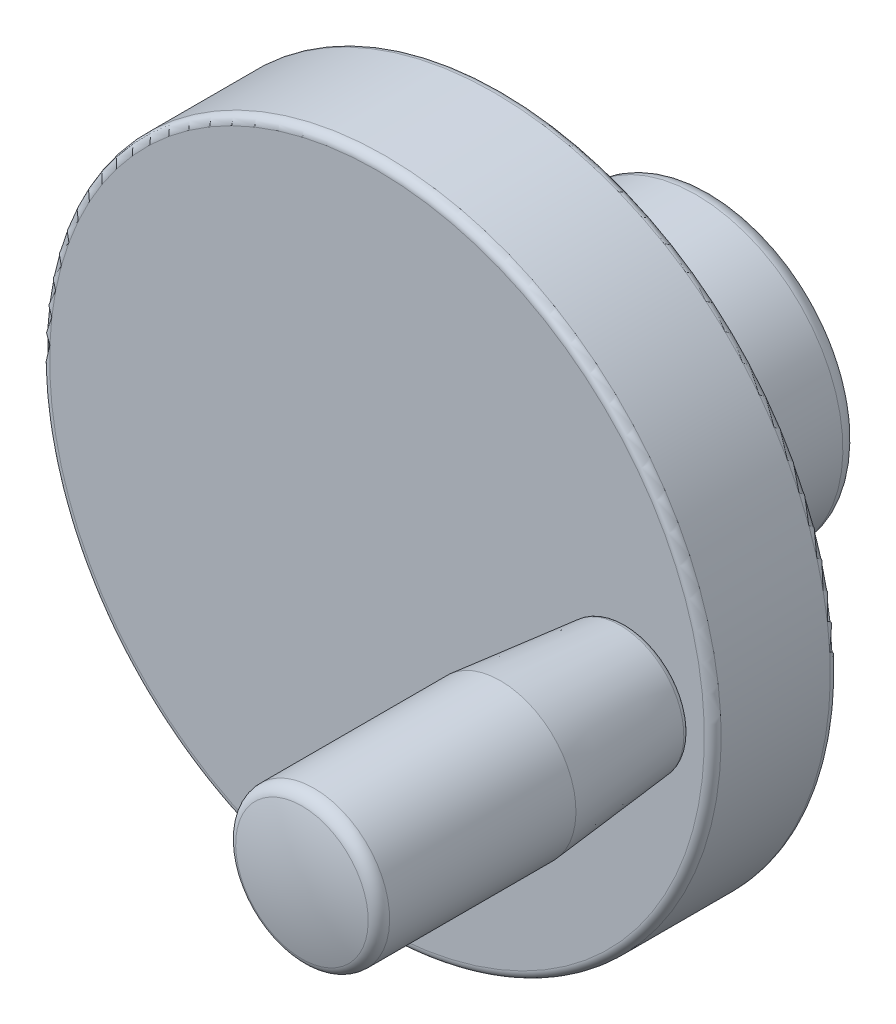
ISO-10303-21;
HEADER;
FILE_DESCRIPTION(('STEP AP214'),'2;1');
FILE_NAME('part.step','',(''),(''),'','','');
FILE_SCHEMA(('AUTOMOTIVE_DESIGN { 1 0 10303 214 1 1 1 1 }'));
ENDSEC;
DATA;
#1=APPLICATION_CONTEXT('core data for automotive mechanical design processes');
#2=APPLICATION_PROTOCOL_DEFINITION('international standard','automotive_design',2000,#1);
#3=PRODUCT_CONTEXT('',#1,'mechanical');
#4=PRODUCT('Part','Part','',(#3));
#5=PRODUCT_RELATED_PRODUCT_CATEGORY('part','',(#4));
#6=PRODUCT_DEFINITION_FORMATION('','',#4);
#7=PRODUCT_DEFINITION_CONTEXT('part definition',#1,'design');
#8=PRODUCT_DEFINITION('design','',#6,#7);
#9=PRODUCT_DEFINITION_SHAPE('','',#8);
#10=(LENGTH_UNIT() NAMED_UNIT(*) SI_UNIT(.MILLI.,.METRE.));
#11=(NAMED_UNIT(*) PLANE_ANGLE_UNIT() SI_UNIT($,.RADIAN.));
#12=(NAMED_UNIT(*) SI_UNIT($,.STERADIAN.) SOLID_ANGLE_UNIT());
#13=UNCERTAINTY_MEASURE_WITH_UNIT(LENGTH_MEASURE(1.E-05),#10,'distance_accuracy_value','');
#14=(GEOMETRIC_REPRESENTATION_CONTEXT(3) GLOBAL_UNCERTAINTY_ASSIGNED_CONTEXT((#13)) GLOBAL_UNIT_ASSIGNED_CONTEXT((#10,
#11,#12)) REPRESENTATION_CONTEXT('',''));
#15=CARTESIAN_POINT('',(0.,0.,0.));
#16=DIRECTION('',(0.,0.,1.));
#17=DIRECTION('',(1.,0.,0.));
#18=AXIS2_PLACEMENT_3D('',#15,#16,#17);
#19=CARTESIAN_POINT('',(0.,0.,40.));
#20=DIRECTION('',(0.,0.,1.));
#21=DIRECTION('',(0.,1.,0.));
#22=AXIS2_PLACEMENT_3D('',#19,#20,#21);
#23=PLANE('',#22);
#24=CARTESIAN_POINT('',(0.,0.,40.));
#25=DIRECTION('',(0.,0.,1.));
#26=DIRECTION('',(0.,1.,0.));
#27=AXIS2_PLACEMENT_3D('',#24,#25,#26);
#28=CIRCLE('',#27,39.);
#29=CARTESIAN_POINT('',(0.,39.,40.));
#30=VERTEX_POINT('',#29);
#31=EDGE_CURVE('E19',#30,#30,#28,.T.);
#32=ORIENTED_EDGE('',*,*,#31,.T.);
#33=EDGE_LOOP('',(#32));
#34=FACE_BOUND('',#33,.T.);
#35=CARTESIAN_POINT('',(30.,0.,40.));
#36=DIRECTION('',(0.,0.,1.));
#37=DIRECTION('',(0.,1.,0.));
#38=AXIS2_PLACEMENT_3D('',#35,#36,#37);
#39=CIRCLE('',#38,5.);
#40=CARTESIAN_POINT('',(30.,5.,40.));
#41=VERTEX_POINT('',#40);
#42=EDGE_CURVE('E62',#41,#41,#39,.T.);
#43=ORIENTED_EDGE('',*,*,#42,.F.);
#44=EDGE_LOOP('',(#43));
#45=FACE_BOUND('',#44,.T.);
#46=ADVANCED_FACE('F12',(#34,#45),#23,.T.);
#47=CARTESIAN_POINT('',(9.,0.,0.));
#48=DIRECTION('',(0.,0.,1.));
#49=DIRECTION('',(0.,1.,0.));
#50=AXIS2_PLACEMENT_3D('',#47,#48,#49);
#51=PLANE('',#50);
#52=CARTESIAN_POINT('',(0.,0.,0.));
#53=DIRECTION('',(0.,0.,1.));
#54=DIRECTION('',(0.,1.,0.));
#55=AXIS2_PLACEMENT_3D('',#52,#53,#54);
#56=CIRCLE('',#55,15.5);
#57=CARTESIAN_POINT('',(0.,15.5,0.));
#58=VERTEX_POINT('',#57);
#59=EDGE_CURVE('E44',#58,#58,#56,.T.);
#60=ORIENTED_EDGE('',*,*,#59,.F.);
#61=EDGE_LOOP('',(#60));
#62=FACE_BOUND('',#61,.T.);
#63=CARTESIAN_POINT('',(0.,0.,0.));
#64=DIRECTION('',(0.,0.,-1.));
#65=DIRECTION('',(0.,1.,0.));
#66=AXIS2_PLACEMENT_3D('',#63,#64,#65);
#67=CIRCLE('',#66,8.);
#68=CARTESIAN_POINT('',(0.,8.,0.));
#69=VERTEX_POINT('',#68);
#70=EDGE_CURVE('E68',#69,#69,#67,.T.);
#71=ORIENTED_EDGE('',*,*,#70,.F.);
#72=EDGE_LOOP('',(#71));
#73=FACE_BOUND('',#72,.T.);
#74=ADVANCED_FACE('F14',(#62,#73),#51,.F.);
#75=CARTESIAN_POINT('',(0.,0.,39.));
#76=DIRECTION('',(0.,0.,1.));
#77=DIRECTION('',(0.,1.,0.));
#78=AXIS2_PLACEMENT_3D('',#75,#76,#77);
#79=TOROIDAL_SURFACE('',#78,39.,1.);
#80=CARTESIAN_POINT('',(0.,0.,39.));
#81=DIRECTION('',(0.,0.,1.));
#82=DIRECTION('',(0.,1.,0.));
#83=AXIS2_PLACEMENT_3D('',#80,#81,#82);
#84=CIRCLE('',#83,40.);
#85=CARTESIAN_POINT('',(0.,40.,39.));
#86=VERTEX_POINT('',#85);
#87=EDGE_CURVE('E23',#86,#86,#84,.T.);
#88=ORIENTED_EDGE('',*,*,#87,.T.);
#89=EDGE_LOOP('',(#88));
#90=FACE_BOUND('',#89,.T.);
#91=ORIENTED_EDGE('',*,*,#31,.F.);
#92=EDGE_LOOP('',(#91));
#93=FACE_BOUND('',#92,.T.);
#94=ADVANCED_FACE('F75',(#90,#93),#79,.T.);
#95=CARTESIAN_POINT('',(0.,0.,45.));
#96=DIRECTION('',(0.,0.,1.));
#97=DIRECTION('',(0.,1.,0.));
#98=AXIS2_PLACEMENT_3D('',#95,#96,#97);
#99=CYLINDRICAL_SURFACE('',#98,40.);
#100=CARTESIAN_POINT('',(0.,0.,26.));
#101=DIRECTION('',(0.,0.,1.));
#102=DIRECTION('',(0.,1.,0.));
#103=AXIS2_PLACEMENT_3D('',#100,#101,#102);
#104=CIRCLE('',#103,40.);
#105=CARTESIAN_POINT('',(0.,40.,26.));
#106=VERTEX_POINT('',#105);
#107=EDGE_CURVE('E27',#106,#106,#104,.T.);
#108=ORIENTED_EDGE('',*,*,#107,.T.);
#109=EDGE_LOOP('',(#108));
#110=FACE_BOUND('',#109,.T.);
#111=ORIENTED_EDGE('',*,*,#87,.F.);
#112=EDGE_LOOP('',(#111));
#113=FACE_BOUND('',#112,.T.);
#114=ADVANCED_FACE('F82',(#110,#113),#99,.T.);
#115=CARTESIAN_POINT('',(0.,0.,26.));
#116=DIRECTION('',(0.,0.,1.));
#117=DIRECTION('',(0.,1.,0.));
#118=AXIS2_PLACEMENT_3D('',#115,#116,#117);
#119=TOROIDAL_SURFACE('',#118,39.,1.);
#120=CARTESIAN_POINT('',(0.,0.,25.));
#121=DIRECTION('',(0.,0.,1.));
#122=DIRECTION('',(0.,1.,0.));
#123=AXIS2_PLACEMENT_3D('',#120,#121,#122);
#124=CIRCLE('',#123,39.);
#125=CARTESIAN_POINT('',(0.,39.,25.));
#126=VERTEX_POINT('',#125);
#127=EDGE_CURVE('E32',#126,#126,#124,.T.);
#128=ORIENTED_EDGE('',*,*,#127,.T.);
#129=EDGE_LOOP('',(#128));
#130=FACE_BOUND('',#129,.T.);
#131=ORIENTED_EDGE('',*,*,#107,.F.);
#132=EDGE_LOOP('',(#131));
#133=FACE_BOUND('',#132,.T.);
#134=ADVANCED_FACE('F109',(#130,#133),#119,.T.);
#135=CARTESIAN_POINT('',(20.5,0.,25.));
#136=DIRECTION('',(0.,0.,1.));
#137=DIRECTION('',(0.,1.,0.));
#138=AXIS2_PLACEMENT_3D('',#135,#136,#137);
#139=PLANE('',#138);
#140=ORIENTED_EDGE('',*,*,#127,.F.);
#141=EDGE_LOOP('',(#140));
#142=FACE_BOUND('',#141,.T.);
#143=CARTESIAN_POINT('',(0.,0.,25.));
#144=DIRECTION('',(0.,0.,1.));
#145=DIRECTION('',(0.,1.,0.));
#146=AXIS2_PLACEMENT_3D('',#143,#144,#145);
#147=CIRCLE('',#146,20.5);
#148=CARTESIAN_POINT('',(0.,20.5,25.));
#149=VERTEX_POINT('',#148);
#150=EDGE_CURVE('E35',#149,#149,#147,.T.);
#151=ORIENTED_EDGE('',*,*,#150,.T.);
#152=EDGE_LOOP('',(#151));
#153=FACE_BOUND('',#152,.T.);
#154=ADVANCED_FACE('F103',(#142,#153),#139,.F.);
#155=CARTESIAN_POINT('',(0.,0.,22.));
#156=DIRECTION('',(0.,0.,1.));
#157=DIRECTION('',(0.,1.,0.));
#158=AXIS2_PLACEMENT_3D('',#155,#156,#157);
#159=TOROIDAL_SURFACE('',#158,20.5,3.);
#160=ORIENTED_EDGE('',*,*,#150,.F.);
#161=EDGE_LOOP('',(#160));
#162=FACE_BOUND('',#161,.T.);
#163=CARTESIAN_POINT('',(0.,0.,22.));
#164=DIRECTION('',(0.,0.,1.));
#165=DIRECTION('',(0.,1.,0.));
#166=AXIS2_PLACEMENT_3D('',#163,#164,#165);
#167=CIRCLE('',#166,17.5);
#168=CARTESIAN_POINT('',(0.,17.5,22.));
#169=VERTEX_POINT('',#168);
#170=EDGE_CURVE('E38',#169,#169,#167,.T.);
#171=ORIENTED_EDGE('',*,*,#170,.T.);
#172=EDGE_LOOP('',(#171));
#173=FACE_BOUND('',#172,.T.);
#174=ADVANCED_FACE('F98',(#162,#173),#159,.F.);
#175=CARTESIAN_POINT('',(0.,0.,45.));
#176=DIRECTION('',(0.,0.,1.));
#177=DIRECTION('',(0.,1.,0.));
#178=AXIS2_PLACEMENT_3D('',#175,#176,#177);
#179=CYLINDRICAL_SURFACE('',#178,17.5);
#180=CARTESIAN_POINT('',(0.,0.,2.));
#181=DIRECTION('',(0.,0.,1.));
#182=DIRECTION('',(0.,1.,0.));
#183=AXIS2_PLACEMENT_3D('',#180,#181,#182);
#184=CIRCLE('',#183,17.5);
#185=CARTESIAN_POINT('',(0.,17.5,2.));
#186=VERTEX_POINT('',#185);
#187=EDGE_CURVE('E41',#186,#186,#184,.T.);
#188=ORIENTED_EDGE('',*,*,#187,.T.);
#189=EDGE_LOOP('',(#188));
#190=FACE_BOUND('',#189,.T.);
#191=ORIENTED_EDGE('',*,*,#170,.F.);
#192=EDGE_LOOP('',(#191));
#193=FACE_BOUND('',#192,.T.);
#194=ADVANCED_FACE('F92',(#190,#193),#179,.T.);
#195=CARTESIAN_POINT('',(0.,0.,2.));
#196=DIRECTION('',(0.,0.,1.));
#197=DIRECTION('',(0.,1.,0.));
#198=AXIS2_PLACEMENT_3D('',#195,#196,#197);
#199=TOROIDAL_SURFACE('',#198,15.5,2.);
#200=ORIENTED_EDGE('',*,*,#59,.T.);
#201=EDGE_LOOP('',(#200));
#202=FACE_BOUND('',#201,.T.);
#203=ORIENTED_EDGE('',*,*,#187,.F.);
#204=EDGE_LOOP('',(#203));
#205=FACE_BOUND('',#204,.T.);
#206=ADVANCED_FACE('F88',(#202,#205),#199,.T.);
#207=CARTESIAN_POINT('',(30.,0.,77.4954523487));
#208=DIRECTION('',(0.,0.,1.));
#209=DIRECTION('',(0.,1.,0.));
#210=AXIS2_PLACEMENT_3D('',#207,#208,#209);
#211=TOROIDAL_SURFACE('',#210,7.50000665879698,1.49999674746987);
#212=CARTESIAN_POINT('',(30.,0.,77.495454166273));
#213=DIRECTION('',(0.,0.,1.));
#214=DIRECTION('',(0.,1.,0.));
#215=AXIS2_PLACEMENT_3D('',#212,#213,#214);
#216=CIRCLE('',#215,9.);
#217=CARTESIAN_POINT('',(30.,9.,77.495454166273));
#218=VERTEX_POINT('',#217);
#219=EDGE_CURVE('E47',#218,#218,#216,.T.);
#220=ORIENTED_EDGE('',*,*,#219,.T.);
#221=EDGE_LOOP('',(#220));
#222=FACE_BOUND('',#221,.T.);
#223=CARTESIAN_POINT('',(30.,0.,78.942578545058));
#224=DIRECTION('',(0.,0.,1.));
#225=DIRECTION('',(0.,1.,0.));
#226=AXIS2_PLACEMENT_3D('',#223,#224,#225);
#227=CIRCLE('',#226,7.89475497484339);
#228=CARTESIAN_POINT('',(30.,7.89475497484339,78.942578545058));
#229=VERTEX_POINT('',#228);
#230=EDGE_CURVE('E65',#229,#229,#227,.T.);
#231=ORIENTED_EDGE('',*,*,#230,.F.);
#232=EDGE_LOOP('',(#231));
#233=FACE_BOUND('',#232,.T.);
#234=ADVANCED_FACE('F91',(#222,#233),#211,.T.);
#235=CARTESIAN_POINT('',(30.,0.,85.));
#236=DIRECTION('',(0.,0.,1.));
#237=DIRECTION('',(0.,1.,0.));
#238=AXIS2_PLACEMENT_3D('',#235,#236,#237);
#239=CYLINDRICAL_SURFACE('',#238,9.);
#240=CARTESIAN_POINT('',(30.,0.,55.3));
#241=DIRECTION('',(0.,0.,1.));
#242=DIRECTION('',(0.,1.,0.));
#243=AXIS2_PLACEMENT_3D('',#240,#241,#242);
#244=CIRCLE('',#243,9.);
#245=CARTESIAN_POINT('',(30.,9.,55.3));
#246=VERTEX_POINT('',#245);
#247=EDGE_CURVE('E50',#246,#246,#244,.T.);
#248=ORIENTED_EDGE('',*,*,#247,.T.);
#249=EDGE_LOOP('',(#248));
#250=FACE_BOUND('',#249,.T.);
#251=ORIENTED_EDGE('',*,*,#219,.F.);
#252=EDGE_LOOP('',(#251));
#253=FACE_BOUND('',#252,.T.);
#254=ADVANCED_FACE('F171',(#250,#253),#239,.T.);
#255=CARTESIAN_POINT('',(30.,0.,55.3));
#256=DIRECTION('',(0.,0.,1.));
#257=DIRECTION('',(0.,1.,0.));
#258=AXIS2_PLACEMENT_3D('',#255,#256,#257);
#259=CONICAL_SURFACE('',#258,9.,0.0996686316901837);
#260=CARTESIAN_POINT('',(30.,0.,41.020397));
#261=DIRECTION('',(0.,0.,1.));
#262=DIRECTION('',(0.,1.,0.));
#263=AXIS2_PLACEMENT_3D('',#260,#261,#262);
#264=CIRCLE('',#263,7.57204);
#265=CARTESIAN_POINT('',(30.,7.57204,41.020397));
#266=VERTEX_POINT('',#265);
#267=EDGE_CURVE('E53',#266,#266,#264,.T.);
#268=ORIENTED_EDGE('',*,*,#267,.T.);
#269=EDGE_LOOP('',(#268));
#270=FACE_BOUND('',#269,.T.);
#271=ORIENTED_EDGE('',*,*,#247,.F.);
#272=EDGE_LOOP('',(#271));
#273=FACE_BOUND('',#272,.T.);
#274=ADVANCED_FACE('F163',(#270,#273),#259,.T.);
#275=CARTESIAN_POINT('',(30.,0.,41.1));
#276=DIRECTION('',(0.,0.,1.));
#277=DIRECTION('',(0.,1.,0.));
#278=AXIS2_PLACEMENT_3D('',#275,#276,#277);
#279=TOROIDAL_SURFACE('',#278,6.77601,0.800000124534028);
#280=CARTESIAN_POINT('',(30.,0.,40.299999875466));
#281=DIRECTION('',(0.,0.,1.));
#282=DIRECTION('',(0.,1.,0.));
#283=AXIS2_PLACEMENT_3D('',#280,#281,#282);
#284=CIRCLE('',#283,6.77601);
#285=CARTESIAN_POINT('',(30.,6.77601,40.299999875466));
#286=VERTEX_POINT('',#285);
#287=EDGE_CURVE('E56',#286,#286,#284,.T.);
#288=ORIENTED_EDGE('',*,*,#287,.T.);
#289=EDGE_LOOP('',(#288));
#290=FACE_BOUND('',#289,.T.);
#291=ORIENTED_EDGE('',*,*,#267,.F.);
#292=EDGE_LOOP('',(#291));
#293=FACE_BOUND('',#292,.T.);
#294=ADVANCED_FACE('F155',(#290,#293),#279,.T.);
#295=CARTESIAN_POINT('',(35.,0.,40.3));
#296=DIRECTION('',(0.,0.,1.));
#297=DIRECTION('',(0.,1.,0.));
#298=AXIS2_PLACEMENT_3D('',#295,#296,#297);
#299=PLANE('',#298);
#300=ORIENTED_EDGE('',*,*,#287,.F.);
#301=EDGE_LOOP('',(#300));
#302=FACE_BOUND('',#301,.T.);
#303=CARTESIAN_POINT('',(30.,0.,40.3));
#304=DIRECTION('',(0.,0.,1.));
#305=DIRECTION('',(0.,1.,0.));
#306=AXIS2_PLACEMENT_3D('',#303,#304,#305);
#307=CIRCLE('',#306,5.);
#308=CARTESIAN_POINT('',(30.,5.,40.3));
#309=VERTEX_POINT('',#308);
#310=EDGE_CURVE('E59',#309,#309,#307,.T.);
#311=ORIENTED_EDGE('',*,*,#310,.T.);
#312=EDGE_LOOP('',(#311));
#313=FACE_BOUND('',#312,.T.);
#314=ADVANCED_FACE('F147',(#302,#313),#299,.F.);
#315=CARTESIAN_POINT('',(30.,0.,85.));
#316=DIRECTION('',(0.,0.,1.));
#317=DIRECTION('',(0.,1.,0.));
#318=AXIS2_PLACEMENT_3D('',#315,#316,#317);
#319=CYLINDRICAL_SURFACE('',#318,5.);
#320=ORIENTED_EDGE('',*,*,#310,.F.);
#321=EDGE_LOOP('',(#320));
#322=FACE_BOUND('',#321,.T.);
#323=ORIENTED_EDGE('',*,*,#42,.T.);
#324=EDGE_LOOP('',(#323));
#325=FACE_BOUND('',#324,.T.);
#326=ADVANCED_FACE('F139',(#322,#325),#319,.T.);
#327=CARTESIAN_POINT('',(30.,0.,49.9999957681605));
#328=DIRECTION('',(0.,1.,0.));
#329=DIRECTION('',(0.,0.,-1.));
#330=AXIS2_PLACEMENT_3D('',#327,#328,#329);
#331=SPHERICAL_SURFACE('',#330,30.0000042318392);
#332=CARTESIAN_POINT('',(30.,0.,49.9999957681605));
#333=DIRECTION('',(0.,0.,1.));
#334=DIRECTION('',(0.,1.,0.));
#335=AXIS2_PLACEMENT_3D('',#332,#333,#334);
#336=SPHERICAL_SURFACE('',#335,30.0000042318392);
#337=ORIENTED_EDGE('',*,*,#230,.T.);
#338=EDGE_LOOP('',(#337));
#339=FACE_BOUND('',#338,.T.);
#340=ADVANCED_FACE('F122',(#339),#336,.T.);
#341=CARTESIAN_POINT('',(8.,0.,28.));
#342=DIRECTION('',(0.,0.,-1.));
#343=DIRECTION('',(0.,-1.,0.));
#344=AXIS2_PLACEMENT_3D('',#341,#342,#343);
#345=PLANE('',#344);
#346=CARTESIAN_POINT('',(0.,0.,28.));
#347=DIRECTION('',(0.,0.,1.));
#348=DIRECTION('',(0.,1.,0.));
#349=AXIS2_PLACEMENT_3D('',#346,#347,#348);
#350=CIRCLE('',#349,8.);
#351=CARTESIAN_POINT('',(0.,8.,28.));
#352=VERTEX_POINT('',#351);
#353=EDGE_CURVE('E8',#352,#352,#350,.T.);
#354=ORIENTED_EDGE('',*,*,#353,.F.);
#355=EDGE_LOOP('',(#354));
#356=FACE_BOUND('',#355,.T.);
#357=ADVANCED_FACE('F120',(#356),#345,.T.);
#358=CARTESIAN_POINT('',(0.,0.,45.));
#359=DIRECTION('',(0.,0.,1.));
#360=DIRECTION('',(0.,1.,0.));
#361=AXIS2_PLACEMENT_3D('',#358,#359,#360);
#362=CYLINDRICAL_SURFACE('',#361,8.);
#363=ORIENTED_EDGE('',*,*,#353,.T.);
#364=EDGE_LOOP('',(#363));
#365=FACE_BOUND('',#364,.T.);
#366=ORIENTED_EDGE('',*,*,#70,.T.);
#367=EDGE_LOOP('',(#366));
#368=FACE_BOUND('',#367,.T.);
#369=ADVANCED_FACE('F72',(#365,#368),#362,.F.);
#370=CLOSED_SHELL('',(#46,#74,#94,#114,#134,#154,#174,#194,#206,#234,#254,#274,#294,#314,#326,
#340,#357,#369));
#371=MANIFOLD_SOLID_BREP('B1',#370);
#372=ADVANCED_BREP_SHAPE_REPRESENTATION('',(#18,#371),#14);
#373=SHAPE_DEFINITION_REPRESENTATION(#9,#372);
ENDSEC;
END-ISO-10303-21;
